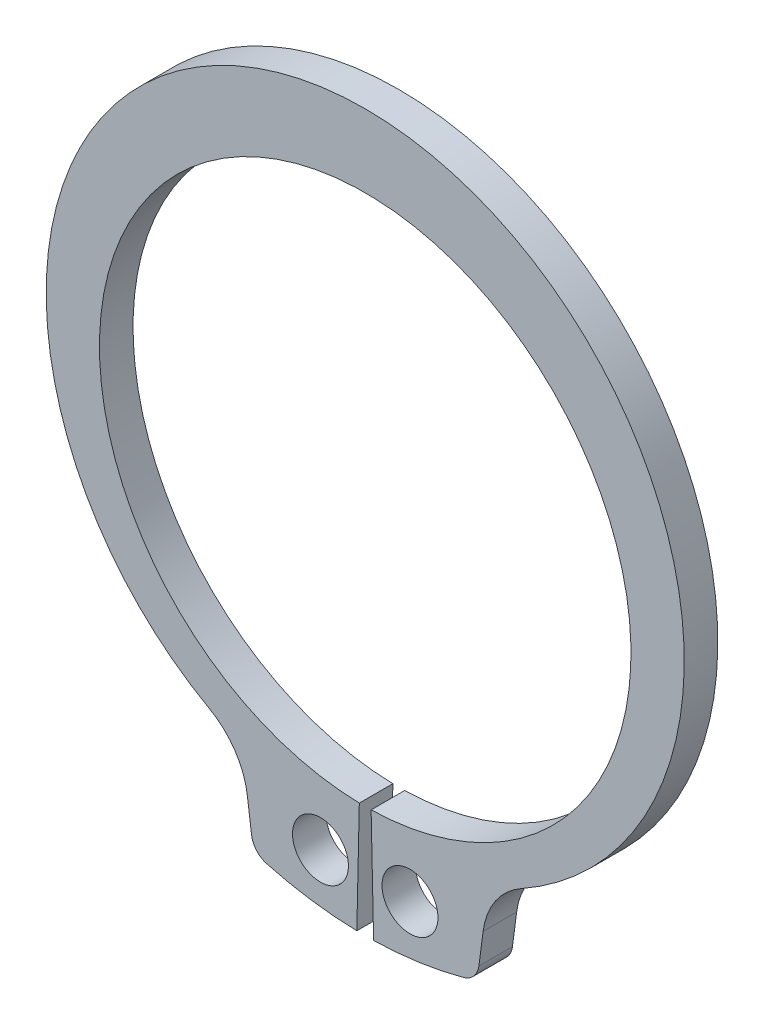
ISO-10303-21;
HEADER;
FILE_DESCRIPTION(('STEP AP214'),'2;1');
FILE_NAME('part.step','',(''),(''),'','','');
FILE_SCHEMA(('AUTOMOTIVE_DESIGN { 1 0 10303 214 1 1 1 1 }'));
ENDSEC;
DATA;
#1=APPLICATION_CONTEXT('core data for automotive mechanical design processes');
#2=APPLICATION_PROTOCOL_DEFINITION('international standard','automotive_design',2000,#1);
#3=PRODUCT_CONTEXT('',#1,'mechanical');
#4=PRODUCT('Part','Part','',(#3));
#5=PRODUCT_RELATED_PRODUCT_CATEGORY('part','',(#4));
#6=PRODUCT_DEFINITION_FORMATION('','',#4);
#7=PRODUCT_DEFINITION_CONTEXT('part definition',#1,'design');
#8=PRODUCT_DEFINITION('design','',#6,#7);
#9=PRODUCT_DEFINITION_SHAPE('','',#8);
#10=(LENGTH_UNIT() NAMED_UNIT(*) SI_UNIT(.MILLI.,.METRE.));
#11=(NAMED_UNIT(*) PLANE_ANGLE_UNIT() SI_UNIT($,.RADIAN.));
#12=(NAMED_UNIT(*) SI_UNIT($,.STERADIAN.) SOLID_ANGLE_UNIT());
#13=UNCERTAINTY_MEASURE_WITH_UNIT(LENGTH_MEASURE(1.E-05),#10,'distance_accuracy_value','');
#14=(GEOMETRIC_REPRESENTATION_CONTEXT(3) GLOBAL_UNCERTAINTY_ASSIGNED_CONTEXT((#13)) GLOBAL_UNIT_ASSIGNED_CONTEXT((#10,
#11,#12)) REPRESENTATION_CONTEXT('',''));
#15=CARTESIAN_POINT('',(0.,0.,0.));
#16=DIRECTION('',(0.,0.,1.));
#17=DIRECTION('',(1.,0.,0.));
#18=AXIS2_PLACEMENT_3D('',#15,#16,#17);
#19=CARTESIAN_POINT('',(0.,0.,-1.19999999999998));
#20=DIRECTION('',(0.,0.,0.999999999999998));
#21=DIRECTION('',(1.,0.,0.));
#22=AXIS2_PLACEMENT_3D('',#19,#20,#21);
#23=CYLINDRICAL_SURFACE('',#22,9.5);
#24=CARTESIAN_POINT('',(0.,0.,0.));
#25=DIRECTION('',(0.,0.,-0.999999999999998));
#26=DIRECTION('',(1.,0.,0.));
#27=AXIS2_PLACEMENT_3D('',#24,#25,#26);
#28=CIRCLE('',#27,9.5);
#29=CARTESIAN_POINT('',(-0.211111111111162,-9.49765403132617,0.));
#30=VERTEX_POINT('',#29);
#31=CARTESIAN_POINT('',(0.211111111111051,-9.49765403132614,0.));
#32=VERTEX_POINT('',#31);
#33=EDGE_CURVE('E131',#30,#32,#28,.T.);
#34=ORIENTED_EDGE('',*,*,#33,.F.);
#35=DIRECTION('',(0.,0.,0.999999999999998));
#36=VECTOR('',#35,1.);
#37=CARTESIAN_POINT('',(-0.211111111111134,-9.49765403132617,-1.19999999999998));
#38=LINE('',#37,#36);
#39=CARTESIAN_POINT('',(-0.211111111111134,-9.49765403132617,-1.19999999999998));
#40=VERTEX_POINT('',#39);
#41=EDGE_CURVE('E11',#40,#30,#38,.T.);
#42=ORIENTED_EDGE('',*,*,#41,.F.);
#43=CARTESIAN_POINT('',(0.,0.,-1.19999999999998));
#44=DIRECTION('',(0.,0.,-0.999999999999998));
#45=DIRECTION('',(1.,0.,0.));
#46=AXIS2_PLACEMENT_3D('',#43,#44,#45);
#47=CIRCLE('',#46,9.5);
#48=CARTESIAN_POINT('',(0.211111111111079,-9.49765403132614,-1.19999999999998));
#49=VERTEX_POINT('',#48);
#50=EDGE_CURVE('E133',#40,#49,#47,.T.);
#51=ORIENTED_EDGE('',*,*,#50,.T.);
#52=DIRECTION('',(0.,0.,0.999999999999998));
#53=VECTOR('',#52,1.);
#54=CARTESIAN_POINT('',(0.211111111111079,-9.49765403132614,-1.19999999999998));
#55=LINE('',#54,#53);
#56=EDGE_CURVE('E45',#49,#32,#55,.T.);
#57=ORIENTED_EDGE('',*,*,#56,.T.);
#58=EDGE_LOOP('',(#34,#42,#51,#57));
#59=FACE_BOUND('',#58,.T.);
#60=ADVANCED_FACE('F42',(#59),#23,.F.);
#61=CARTESIAN_POINT('',(-0.211111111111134,-9.49765403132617,-1.19999999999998));
#62=DIRECTION('',(0.999753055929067,-0.0222222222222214,0.));
#63=DIRECTION('',(0.0222222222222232,0.999753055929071,0.));
#64=AXIS2_PLACEMENT_3D('',#61,#62,#63);
#65=PLANE('',#64);
#66=DIRECTION('',(0.0222222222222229,0.99975305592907,0.));
#67=VECTOR('',#66,1.);
#68=CARTESIAN_POINT('',(-0.211111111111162,-9.49765403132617,0.));
#69=LINE('',#68,#67);
#70=CARTESIAN_POINT('',(-0.30000000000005,-13.4966662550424,0.));
#71=VERTEX_POINT('',#70);
#72=EDGE_CURVE('E151',#71,#30,#69,.T.);
#73=ORIENTED_EDGE('',*,*,#72,.F.);
#74=DIRECTION('',(0.,0.,0.999999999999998));
#75=VECTOR('',#74,1.);
#76=CARTESIAN_POINT('',(-0.30000000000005,-13.4966662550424,-1.19999999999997));
#77=LINE('',#76,#75);
#78=CARTESIAN_POINT('',(-0.30000000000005,-13.4966662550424,-1.19999999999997));
#79=VERTEX_POINT('',#78);
#80=EDGE_CURVE('E51',#79,#71,#77,.T.);
#81=ORIENTED_EDGE('',*,*,#80,.F.);
#82=DIRECTION('',(0.0222222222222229,0.99975305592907,0.));
#83=VECTOR('',#82,1.);
#84=CARTESIAN_POINT('',(-0.211111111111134,-9.49765403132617,-1.19999999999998));
#85=LINE('',#84,#83);
#86=EDGE_CURVE('E139',#79,#40,#85,.T.);
#87=ORIENTED_EDGE('',*,*,#86,.T.);
#88=ORIENTED_EDGE('',*,*,#41,.T.);
#89=EDGE_LOOP('',(#73,#81,#87,#88));
#90=FACE_BOUND('',#89,.T.);
#91=ADVANCED_FACE('F295',(#90),#65,.T.);
#92=CARTESIAN_POINT('',(0.,0.,-1.19999999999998));
#93=DIRECTION('',(0.,0.,0.999999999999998));
#94=DIRECTION('',(1.,0.,0.));
#95=AXIS2_PLACEMENT_3D('',#92,#93,#94);
#96=CYLINDRICAL_SURFACE('',#95,13.5);
#97=CARTESIAN_POINT('',(0.,0.,0.));
#98=DIRECTION('',(0.,0.,0.999999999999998));
#99=DIRECTION('',(1.,0.,0.));
#100=AXIS2_PLACEMENT_3D('',#97,#98,#99);
#101=CIRCLE('',#100,13.5);
#102=CARTESIAN_POINT('',(-3.51438519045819,-13.0345347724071,0.));
#103=VERTEX_POINT('',#102);
#104=EDGE_CURVE('E192',#103,#71,#101,.T.);
#105=ORIENTED_EDGE('',*,*,#104,.F.);
#106=DIRECTION('',(0.,0.,0.999999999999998));
#107=VECTOR('',#106,1.);
#108=CARTESIAN_POINT('',(-3.51438519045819,-13.0345347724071,-1.19999999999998));
#109=LINE('',#108,#107);
#110=CARTESIAN_POINT('',(-3.51438519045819,-13.0345347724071,-1.19999999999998));
#111=VERTEX_POINT('',#110);
#112=EDGE_CURVE('E241',#111,#103,#109,.T.);
#113=ORIENTED_EDGE('',*,*,#112,.F.);
#114=CARTESIAN_POINT('',(0.,0.,-1.19999999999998));
#115=DIRECTION('',(0.,0.,0.999999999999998));
#116=DIRECTION('',(1.,0.,0.));
#117=AXIS2_PLACEMENT_3D('',#114,#115,#116);
#118=CIRCLE('',#117,13.5);
#119=EDGE_CURVE('E234',#111,#79,#118,.T.);
#120=ORIENTED_EDGE('',*,*,#119,.T.);
#121=ORIENTED_EDGE('',*,*,#80,.T.);
#122=EDGE_LOOP('',(#105,#113,#120,#121));
#123=FACE_BOUND('',#122,.T.);
#124=ADVANCED_FACE('F299',(#123),#96,.T.);
#125=CARTESIAN_POINT('',(-3.31914156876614,-12.3103939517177,-1.19999999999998));
#126=DIRECTION('',(0.,0.,0.999999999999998));
#127=DIRECTION('',(1.,0.,0.));
#128=AXIS2_PLACEMENT_3D('',#125,#126,#127);
#129=CYLINDRICAL_SURFACE('',#128,0.75);
#130=CARTESIAN_POINT('',(-3.31914156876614,-12.3103939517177,0.));
#131=DIRECTION('',(0.,0.,0.999999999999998));
#132=DIRECTION('',(1.,0.,0.));
#133=AXIS2_PLACEMENT_3D('',#130,#131,#132);
#134=CIRCLE('',#133,0.75);
#135=CARTESIAN_POINT('',(-4.06272521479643,-12.4082885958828,0.));
#136=VERTEX_POINT('',#135);
#137=EDGE_CURVE('E188',#136,#103,#134,.T.);
#138=ORIENTED_EDGE('',*,*,#137,.F.);
#139=DIRECTION('',(0.,0.,0.999999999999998));
#140=VECTOR('',#139,1.);
#141=CARTESIAN_POINT('',(-4.06272521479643,-12.4082885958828,-1.19999999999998));
#142=LINE('',#141,#140);
#143=CARTESIAN_POINT('',(-4.06272521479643,-12.4082885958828,-1.19999999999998));
#144=VERTEX_POINT('',#143);
#145=EDGE_CURVE('E244',#144,#136,#142,.T.);
#146=ORIENTED_EDGE('',*,*,#145,.F.);
#147=CARTESIAN_POINT('',(-3.31914156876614,-12.3103939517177,-1.19999999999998));
#148=DIRECTION('',(0.,0.,0.999999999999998));
#149=DIRECTION('',(1.,0.,0.));
#150=AXIS2_PLACEMENT_3D('',#147,#148,#149);
#151=CIRCLE('',#150,0.75);
#152=EDGE_CURVE('E230',#144,#111,#151,.T.);
#153=ORIENTED_EDGE('',*,*,#152,.T.);
#154=ORIENTED_EDGE('',*,*,#112,.T.);
#155=EDGE_LOOP('',(#138,#146,#153,#154));
#156=FACE_BOUND('',#155,.T.);
#157=ADVANCED_FACE('F304',(#156),#129,.T.);
#158=CARTESIAN_POINT('',(-4.21429248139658,-11.2570209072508,-1.19999999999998));
#159=DIRECTION('',(-0.991444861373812,-0.130526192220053,0.));
#160=DIRECTION('',(0.130526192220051,-0.991444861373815,0.));
#161=AXIS2_PLACEMENT_3D('',#158,#159,#160);
#162=PLANE('',#161);
#163=DIRECTION('',(0.130526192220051,-0.991444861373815,0.));
#164=VECTOR('',#163,1.);
#165=CARTESIAN_POINT('',(-4.21429248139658,-11.2570209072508,0.));
#166=LINE('',#165,#164);
#167=CARTESIAN_POINT('',(-4.21429248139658,-11.2570209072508,0.));
#168=VERTEX_POINT('',#167);
#169=EDGE_CURVE('E185',#168,#136,#166,.T.);
#170=ORIENTED_EDGE('',*,*,#169,.F.);
#171=DIRECTION('',(0.,0.,0.999999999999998));
#172=VECTOR('',#171,1.);
#173=CARTESIAN_POINT('',(-4.21429248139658,-11.2570209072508,-1.19999999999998));
#174=LINE('',#173,#172);
#175=CARTESIAN_POINT('',(-4.21429248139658,-11.2570209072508,-1.19999999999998));
#176=VERTEX_POINT('',#175);
#177=EDGE_CURVE('E247',#176,#168,#174,.T.);
#178=ORIENTED_EDGE('',*,*,#177,.F.);
#179=DIRECTION('',(0.130526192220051,-0.991444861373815,0.));
#180=VECTOR('',#179,1.);
#181=CARTESIAN_POINT('',(-4.21429248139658,-11.2570209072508,-1.19999999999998));
#182=LINE('',#181,#180);
#183=EDGE_CURVE('E226',#176,#144,#182,.T.);
#184=ORIENTED_EDGE('',*,*,#183,.T.);
#185=ORIENTED_EDGE('',*,*,#145,.T.);
#186=EDGE_LOOP('',(#170,#178,#184,#185));
#187=FACE_BOUND('',#186,.T.);
#188=ADVANCED_FACE('F311',(#187),#162,.T.);
#189=CARTESIAN_POINT('',(-6.89014336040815,-11.6093033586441,-1.19999999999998));
#190=DIRECTION('',(0.,0.,0.999999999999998));
#191=DIRECTION('',(1.,0.,0.));
#192=AXIS2_PLACEMENT_3D('',#189,#190,#191);
#193=CYLINDRICAL_SURFACE('',#192,2.69894069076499);
#194=CARTESIAN_POINT('',(-6.89014336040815,-11.6093033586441,0.));
#195=DIRECTION('',(0.,0.,-0.999999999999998));
#196=DIRECTION('',(1.,0.,0.));
#197=AXIS2_PLACEMENT_3D('',#194,#195,#196);
#198=CIRCLE('',#197,2.69894069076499);
#199=CARTESIAN_POINT('',(-5.57154974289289,-9.25439535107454,0.));
#200=VERTEX_POINT('',#199);
#201=EDGE_CURVE('E181',#200,#168,#198,.T.);
#202=ORIENTED_EDGE('',*,*,#201,.F.);
#203=DIRECTION('',(0.,0.,0.999999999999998));
#204=VECTOR('',#203,1.);
#205=CARTESIAN_POINT('',(-5.57154974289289,-9.25439535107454,-1.19999999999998));
#206=LINE('',#205,#204);
#207=CARTESIAN_POINT('',(-5.57154974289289,-9.25439535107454,-1.19999999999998));
#208=VERTEX_POINT('',#207);
#209=EDGE_CURVE('E250',#208,#200,#206,.T.);
#210=ORIENTED_EDGE('',*,*,#209,.F.);
#211=CARTESIAN_POINT('',(-6.89014336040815,-11.6093033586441,-1.19999999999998));
#212=DIRECTION('',(0.,0.,-0.999999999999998));
#213=DIRECTION('',(1.,0.,0.));
#214=AXIS2_PLACEMENT_3D('',#211,#212,#213);
#215=CIRCLE('',#214,2.69894069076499);
#216=EDGE_CURVE('E222',#208,#176,#215,.T.);
#217=ORIENTED_EDGE('',*,*,#216,.T.);
#218=ORIENTED_EDGE('',*,*,#177,.T.);
#219=EDGE_LOOP('',(#202,#210,#217,#218));
#220=FACE_BOUND('',#219,.T.);
#221=ADVANCED_FACE('F315',(#220),#193,.F.);
#222=CARTESIAN_POINT('',(0.,0.695969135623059,-1.19999999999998));
#223=DIRECTION('',(0.,0.,0.999999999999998));
#224=DIRECTION('',(1.,0.,0.));
#225=AXIS2_PLACEMENT_3D('',#222,#223,#224);
#226=CYLINDRICAL_SURFACE('',#225,11.4040308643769);
#227=CARTESIAN_POINT('',(0.,0.695969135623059,0.));
#228=DIRECTION('',(0.,0.,0.999999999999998));
#229=DIRECTION('',(1.,0.,0.));
#230=AXIS2_PLACEMENT_3D('',#227,#228,#229);
#231=CIRCLE('',#230,11.4040308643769);
#232=CARTESIAN_POINT('',(5.57154974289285,-9.25439535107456,0.));
#233=VERTEX_POINT('',#232);
#234=EDGE_CURVE('E177',#233,#200,#231,.T.);
#235=ORIENTED_EDGE('',*,*,#234,.F.);
#236=DIRECTION('',(0.,0.,0.999999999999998));
#237=VECTOR('',#236,1.);
#238=CARTESIAN_POINT('',(5.57154974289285,-9.25439535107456,-1.19999999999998));
#239=LINE('',#238,#237);
#240=CARTESIAN_POINT('',(5.57154974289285,-9.25439535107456,-1.19999999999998));
#241=VERTEX_POINT('',#240);
#242=EDGE_CURVE('E253',#241,#233,#239,.T.);
#243=ORIENTED_EDGE('',*,*,#242,.F.);
#244=CARTESIAN_POINT('',(0.,0.695969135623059,-1.19999999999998));
#245=DIRECTION('',(0.,0.,0.999999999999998));
#246=DIRECTION('',(1.,0.,0.));
#247=AXIS2_PLACEMENT_3D('',#244,#245,#246);
#248=CIRCLE('',#247,11.4040308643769);
#249=EDGE_CURVE('E218',#241,#208,#248,.T.);
#250=ORIENTED_EDGE('',*,*,#249,.T.);
#251=ORIENTED_EDGE('',*,*,#209,.T.);
#252=EDGE_LOOP('',(#235,#243,#250,#251));
#253=FACE_BOUND('',#252,.T.);
#254=ADVANCED_FACE('F319',(#253),#226,.T.);
#255=CARTESIAN_POINT('',(6.89014336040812,-11.609303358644,-1.19999999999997));
#256=DIRECTION('',(0.,0.,0.999999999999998));
#257=DIRECTION('',(1.,0.,0.));
#258=AXIS2_PLACEMENT_3D('',#255,#256,#257);
#259=CYLINDRICAL_SURFACE('',#258,2.69894069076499);
#260=CARTESIAN_POINT('',(6.89014336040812,-11.609303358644,0.));
#261=DIRECTION('',(0.,0.,-0.999999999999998));
#262=DIRECTION('',(1.,0.,0.));
#263=AXIS2_PLACEMENT_3D('',#260,#261,#262);
#264=CIRCLE('',#263,2.69894069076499);
#265=CARTESIAN_POINT('',(4.21429248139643,-11.2570209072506,0.));
#266=VERTEX_POINT('',#265);
#267=EDGE_CURVE('E173',#266,#233,#264,.T.);
#268=ORIENTED_EDGE('',*,*,#267,.F.);
#269=DIRECTION('',(0.,0.,0.999999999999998));
#270=VECTOR('',#269,1.);
#271=CARTESIAN_POINT('',(4.21429248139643,-11.2570209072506,-1.19999999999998));
#272=LINE('',#271,#270);
#273=CARTESIAN_POINT('',(4.21429248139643,-11.2570209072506,-1.19999999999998));
#274=VERTEX_POINT('',#273);
#275=EDGE_CURVE('E255',#274,#266,#272,.T.);
#276=ORIENTED_EDGE('',*,*,#275,.F.);
#277=CARTESIAN_POINT('',(6.89014336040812,-11.609303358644,-1.19999999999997));
#278=DIRECTION('',(0.,0.,-0.999999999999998));
#279=DIRECTION('',(1.,0.,0.));
#280=AXIS2_PLACEMENT_3D('',#277,#278,#279);
#281=CIRCLE('',#280,2.69894069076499);
#282=EDGE_CURVE('E214',#274,#241,#281,.T.);
#283=ORIENTED_EDGE('',*,*,#282,.T.);
#284=ORIENTED_EDGE('',*,*,#242,.T.);
#285=EDGE_LOOP('',(#268,#276,#283,#284));
#286=FACE_BOUND('',#285,.T.);
#287=ADVANCED_FACE('F323',(#286),#259,.F.);
#288=CARTESIAN_POINT('',(4.21429248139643,-11.2570209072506,-1.19999999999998));
#289=DIRECTION('',(0.991444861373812,-0.130526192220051,0.));
#290=DIRECTION('',(0.130526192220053,0.991444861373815,0.));
#291=AXIS2_PLACEMENT_3D('',#288,#289,#290);
#292=PLANE('',#291);
#293=DIRECTION('',(0.130526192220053,0.991444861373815,0.));
#294=VECTOR('',#293,1.);
#295=CARTESIAN_POINT('',(4.21429248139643,-11.2570209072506,0.));
#296=LINE('',#295,#294);
#297=CARTESIAN_POINT('',(4.06272521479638,-12.4082885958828,0.));
#298=VERTEX_POINT('',#297);
#299=EDGE_CURVE('E169',#298,#266,#296,.T.);
#300=ORIENTED_EDGE('',*,*,#299,.F.);
#301=DIRECTION('',(0.,0.,0.999999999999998));
#302=VECTOR('',#301,1.);
#303=CARTESIAN_POINT('',(4.06272521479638,-12.4082885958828,-1.19999999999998));
#304=LINE('',#303,#302);
#305=CARTESIAN_POINT('',(4.06272521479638,-12.4082885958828,-1.19999999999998));
#306=VERTEX_POINT('',#305);
#307=EDGE_CURVE('E258',#306,#298,#304,.T.);
#308=ORIENTED_EDGE('',*,*,#307,.F.);
#309=DIRECTION('',(0.130526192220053,0.991444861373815,0.));
#310=VECTOR('',#309,1.);
#311=CARTESIAN_POINT('',(4.21429248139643,-11.2570209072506,-1.19999999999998));
#312=LINE('',#311,#310);
#313=EDGE_CURVE('E210',#306,#274,#312,.T.);
#314=ORIENTED_EDGE('',*,*,#313,.T.);
#315=ORIENTED_EDGE('',*,*,#275,.T.);
#316=EDGE_LOOP('',(#300,#308,#314,#315));
#317=FACE_BOUND('',#316,.T.);
#318=ADVANCED_FACE('F327',(#317),#292,.T.);
#319=CARTESIAN_POINT('',(3.31914156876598,-12.3103939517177,-1.19999999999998));
#320=DIRECTION('',(0.,0.,0.999999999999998));
#321=DIRECTION('',(1.,0.,0.));
#322=AXIS2_PLACEMENT_3D('',#319,#320,#321);
#323=CYLINDRICAL_SURFACE('',#322,0.75);
#324=CARTESIAN_POINT('',(3.31914156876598,-12.3103939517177,0.));
#325=DIRECTION('',(0.,0.,0.999999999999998));
#326=DIRECTION('',(-1.,0.,0.));
#327=AXIS2_PLACEMENT_3D('',#324,#325,#326);
#328=CIRCLE('',#327,0.75);
#329=CARTESIAN_POINT('',(3.51438519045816,-13.034534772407,0.));
#330=VERTEX_POINT('',#329);
#331=EDGE_CURVE('E165',#330,#298,#328,.T.);
#332=ORIENTED_EDGE('',*,*,#331,.F.);
#333=DIRECTION('',(0.,0.,0.999999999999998));
#334=VECTOR('',#333,1.);
#335=CARTESIAN_POINT('',(3.51438519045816,-13.034534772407,-1.19999999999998));
#336=LINE('',#335,#334);
#337=CARTESIAN_POINT('',(3.51438519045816,-13.034534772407,-1.19999999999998));
#338=VERTEX_POINT('',#337);
#339=EDGE_CURVE('E261',#338,#330,#336,.T.);
#340=ORIENTED_EDGE('',*,*,#339,.F.);
#341=CARTESIAN_POINT('',(3.31914156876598,-12.3103939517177,-1.19999999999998));
#342=DIRECTION('',(0.,0.,0.999999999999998));
#343=DIRECTION('',(-1.,0.,0.));
#344=AXIS2_PLACEMENT_3D('',#341,#342,#343);
#345=CIRCLE('',#344,0.75);
#346=EDGE_CURVE('E206',#338,#306,#345,.T.);
#347=ORIENTED_EDGE('',*,*,#346,.T.);
#348=ORIENTED_EDGE('',*,*,#307,.T.);
#349=EDGE_LOOP('',(#332,#340,#347,#348));
#350=FACE_BOUND('',#349,.T.);
#351=ADVANCED_FACE('F331',(#350),#323,.T.);
#352=CARTESIAN_POINT('',(0.,0.,-1.19999999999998));
#353=DIRECTION('',(0.,0.,0.999999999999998));
#354=DIRECTION('',(1.,0.,0.));
#355=AXIS2_PLACEMENT_3D('',#352,#353,#354);
#356=CYLINDRICAL_SURFACE('',#355,13.5);
#357=CARTESIAN_POINT('',(0.,0.,0.));
#358=DIRECTION('',(0.,0.,0.999999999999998));
#359=DIRECTION('',(1.,0.,0.));
#360=AXIS2_PLACEMENT_3D('',#357,#358,#359);
#361=CIRCLE('',#360,13.5);
#362=CARTESIAN_POINT('',(0.299999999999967,-13.4966662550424,0.));
#363=VERTEX_POINT('',#362);
#364=EDGE_CURVE('E147',#363,#330,#361,.T.);
#365=ORIENTED_EDGE('',*,*,#364,.F.);
#366=DIRECTION('',(0.,0.,0.999999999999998));
#367=VECTOR('',#366,1.);
#368=CARTESIAN_POINT('',(0.299999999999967,-13.4966662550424,-1.19999999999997));
#369=LINE('',#368,#367);
#370=CARTESIAN_POINT('',(0.299999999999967,-13.4966662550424,-1.19999999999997));
#371=VERTEX_POINT('',#370);
#372=EDGE_CURVE('E138',#371,#363,#369,.T.);
#373=ORIENTED_EDGE('',*,*,#372,.F.);
#374=CARTESIAN_POINT('',(0.,0.,-1.19999999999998));
#375=DIRECTION('',(0.,0.,0.999999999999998));
#376=DIRECTION('',(1.,0.,0.));
#377=AXIS2_PLACEMENT_3D('',#374,#375,#376);
#378=CIRCLE('',#377,13.5);
#379=EDGE_CURVE('E202',#371,#338,#378,.T.);
#380=ORIENTED_EDGE('',*,*,#379,.T.);
#381=ORIENTED_EDGE('',*,*,#339,.T.);
#382=EDGE_LOOP('',(#365,#373,#380,#381));
#383=FACE_BOUND('',#382,.T.);
#384=ADVANCED_FACE('F335',(#383),#356,.T.);
#385=CARTESIAN_POINT('',(0.211111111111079,-9.49765403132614,-1.19999999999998));
#386=DIRECTION('',(-0.999753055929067,-0.0222222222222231,0.));
#387=DIRECTION('',(0.0222222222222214,-0.99975305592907,0.));
#388=AXIS2_PLACEMENT_3D('',#385,#386,#387);
#389=PLANE('',#388);
#390=DIRECTION('',(0.0222222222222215,-0.99975305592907,0.));
#391=VECTOR('',#390,1.);
#392=CARTESIAN_POINT('',(0.211111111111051,-9.49765403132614,0.));
#393=LINE('',#392,#391);
#394=EDGE_CURVE('E141',#32,#363,#393,.T.);
#395=ORIENTED_EDGE('',*,*,#394,.F.);
#396=ORIENTED_EDGE('',*,*,#56,.F.);
#397=DIRECTION('',(0.0222222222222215,-0.99975305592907,0.));
#398=VECTOR('',#397,1.);
#399=CARTESIAN_POINT('',(0.211111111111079,-9.49765403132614,-1.19999999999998));
#400=LINE('',#399,#398);
#401=EDGE_CURVE('E199',#49,#371,#400,.T.);
#402=ORIENTED_EDGE('',*,*,#401,.T.);
#403=ORIENTED_EDGE('',*,*,#372,.T.);
#404=EDGE_LOOP('',(#395,#396,#402,#403));
#405=FACE_BOUND('',#404,.T.);
#406=ADVANCED_FACE('F142',(#405),#389,.T.);
#407=CARTESIAN_POINT('',(0.,0.,-1.19999999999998));
#408=DIRECTION('',(0.,0.,0.999999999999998));
#409=DIRECTION('',(1.,0.,0.));
#410=AXIS2_PLACEMENT_3D('',#407,#408,#409);
#411=PLANE('',#410);
#412=CARTESIAN_POINT('',(-1.60000000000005,-11.6405541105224,-1.19999999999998));
#413=DIRECTION('',(0.,0.,0.999999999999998));
#414=DIRECTION('',(1.,0.,0.));
#415=AXIS2_PLACEMENT_3D('',#412,#413,#414);
#416=CIRCLE('',#415,1.);
#417=CARTESIAN_POINT('',(-0.600000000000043,-11.6405541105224,-1.19999999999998));
#418=VERTEX_POINT('',#417);
#419=EDGE_CURVE('E267',#418,#418,#416,.T.);
#420=ORIENTED_EDGE('',*,*,#419,.T.);
#421=EDGE_LOOP('',(#420));
#422=FACE_BOUND('',#421,.T.);
#423=CARTESIAN_POINT('',(1.59999999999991,-11.6405541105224,-1.19999999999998));
#424=DIRECTION('',(0.,0.,0.999999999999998));
#425=DIRECTION('',(1.,0.,0.));
#426=AXIS2_PLACEMENT_3D('',#423,#424,#425);
#427=CIRCLE('',#426,1.);
#428=CARTESIAN_POINT('',(2.59999999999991,-11.6405541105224,-1.19999999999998));
#429=VERTEX_POINT('',#428);
#430=EDGE_CURVE('E153',#429,#429,#427,.T.);
#431=ORIENTED_EDGE('',*,*,#430,.T.);
#432=EDGE_LOOP('',(#431));
#433=FACE_BOUND('',#432,.T.);
#434=ORIENTED_EDGE('',*,*,#50,.F.);
#435=ORIENTED_EDGE('',*,*,#86,.F.);
#436=ORIENTED_EDGE('',*,*,#119,.F.);
#437=ORIENTED_EDGE('',*,*,#152,.F.);
#438=ORIENTED_EDGE('',*,*,#183,.F.);
#439=ORIENTED_EDGE('',*,*,#216,.F.);
#440=ORIENTED_EDGE('',*,*,#249,.F.);
#441=ORIENTED_EDGE('',*,*,#282,.F.);
#442=ORIENTED_EDGE('',*,*,#313,.F.);
#443=ORIENTED_EDGE('',*,*,#346,.F.);
#444=ORIENTED_EDGE('',*,*,#379,.F.);
#445=ORIENTED_EDGE('',*,*,#401,.F.);
#446=EDGE_LOOP('',(#434,#435,#436,#437,#438,#439,#440,#441,#442,#443,#444,#445));
#447=FACE_BOUND('',#446,.T.);
#448=ADVANCED_FACE('F281',(#422,#433,#447),#411,.F.);
#449=CARTESIAN_POINT('',(0.,0.,0.));
#450=DIRECTION('',(0.,0.,0.999999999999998));
#451=DIRECTION('',(1.,0.,0.));
#452=AXIS2_PLACEMENT_3D('',#449,#450,#451);
#453=PLANE('',#452);
#454=CARTESIAN_POINT('',(-1.60000000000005,-11.6405541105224,0.));
#455=DIRECTION('',(0.,0.,0.999999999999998));
#456=DIRECTION('',(1.,0.,0.));
#457=AXIS2_PLACEMENT_3D('',#454,#455,#456);
#458=CIRCLE('',#457,1.);
#459=CARTESIAN_POINT('',(-0.600000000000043,-11.6405541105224,0.));
#460=VERTEX_POINT('',#459);
#461=EDGE_CURVE('E269',#460,#460,#458,.T.);
#462=ORIENTED_EDGE('',*,*,#461,.F.);
#463=EDGE_LOOP('',(#462));
#464=FACE_BOUND('',#463,.T.);
#465=CARTESIAN_POINT('',(1.59999999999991,-11.6405541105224,0.));
#466=DIRECTION('',(0.,0.,0.999999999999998));
#467=DIRECTION('',(1.,0.,0.));
#468=AXIS2_PLACEMENT_3D('',#465,#466,#467);
#469=CIRCLE('',#468,1.);
#470=CARTESIAN_POINT('',(2.59999999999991,-11.6405541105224,0.));
#471=VERTEX_POINT('',#470);
#472=EDGE_CURVE('E159',#471,#471,#469,.T.);
#473=ORIENTED_EDGE('',*,*,#472,.F.);
#474=EDGE_LOOP('',(#473));
#475=FACE_BOUND('',#474,.T.);
#476=ORIENTED_EDGE('',*,*,#33,.T.);
#477=ORIENTED_EDGE('',*,*,#394,.T.);
#478=ORIENTED_EDGE('',*,*,#364,.T.);
#479=ORIENTED_EDGE('',*,*,#331,.T.);
#480=ORIENTED_EDGE('',*,*,#299,.T.);
#481=ORIENTED_EDGE('',*,*,#267,.T.);
#482=ORIENTED_EDGE('',*,*,#234,.T.);
#483=ORIENTED_EDGE('',*,*,#201,.T.);
#484=ORIENTED_EDGE('',*,*,#169,.T.);
#485=ORIENTED_EDGE('',*,*,#137,.T.);
#486=ORIENTED_EDGE('',*,*,#104,.T.);
#487=ORIENTED_EDGE('',*,*,#72,.T.);
#488=EDGE_LOOP('',(#476,#477,#478,#479,#480,#481,#482,#483,#484,#485,#486,#487));
#489=FACE_BOUND('',#488,.T.);
#490=ADVANCED_FACE('F149',(#464,#475,#489),#453,.T.);
#491=CARTESIAN_POINT('',(1.59999999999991,-11.6405541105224,-1.19999999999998));
#492=DIRECTION('',(0.,0.,0.999999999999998));
#493=DIRECTION('',(1.,0.,0.));
#494=AXIS2_PLACEMENT_3D('',#491,#492,#493);
#495=CYLINDRICAL_SURFACE('',#494,1.);
#496=CARTESIAN_POINT('',(2.59999999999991,-11.6405541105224,-1.19999999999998));
#497=CARTESIAN_POINT('',(2.59999999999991,-11.6405541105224,-1.18749999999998));
#498=CARTESIAN_POINT('',(2.59999999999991,-11.6405541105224,-1.17499999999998));
#499=CARTESIAN_POINT('',(2.59999999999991,-11.6405541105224,-1.14999999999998));
#500=CARTESIAN_POINT('',(2.59999999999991,-11.6405541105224,-1.13749999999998));
#501=CARTESIAN_POINT('',(2.59999999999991,-11.6405541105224,-1.11249999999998));
#502=CARTESIAN_POINT('',(2.59999999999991,-11.6405541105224,-1.09999999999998));
#503=CARTESIAN_POINT('',(2.59999999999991,-11.6405541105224,-1.07499999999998));
#504=CARTESIAN_POINT('',(2.59999999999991,-11.6405541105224,-1.06249999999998));
#505=CARTESIAN_POINT('',(2.59999999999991,-11.6405541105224,-1.03749999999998));
#506=CARTESIAN_POINT('',(2.59999999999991,-11.6405541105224,-1.02499999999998));
#507=CARTESIAN_POINT('',(2.59999999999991,-11.6405541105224,-0.999999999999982));
#508=CARTESIAN_POINT('',(2.59999999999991,-11.6405541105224,-0.987499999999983));
#509=CARTESIAN_POINT('',(2.59999999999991,-11.6405541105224,-0.962499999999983));
#510=CARTESIAN_POINT('',(2.59999999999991,-11.6405541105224,-0.949999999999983));
#511=CARTESIAN_POINT('',(2.59999999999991,-11.6405541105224,-0.924999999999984));
#512=CARTESIAN_POINT('',(2.59999999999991,-11.6405541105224,-0.912499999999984));
#513=CARTESIAN_POINT('',(2.59999999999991,-11.6405541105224,-0.887499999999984));
#514=CARTESIAN_POINT('',(2.59999999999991,-11.6405541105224,-0.874999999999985));
#515=CARTESIAN_POINT('',(2.59999999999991,-11.6405541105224,-0.849999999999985));
#516=CARTESIAN_POINT('',(2.59999999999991,-11.6405541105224,-0.837499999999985));
#517=CARTESIAN_POINT('',(2.59999999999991,-11.6405541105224,-0.812499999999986));
#518=CARTESIAN_POINT('',(2.59999999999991,-11.6405541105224,-0.799999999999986));
#519=CARTESIAN_POINT('',(2.59999999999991,-11.6405541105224,-0.774999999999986));
#520=CARTESIAN_POINT('',(2.59999999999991,-11.6405541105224,-0.762499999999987));
#521=CARTESIAN_POINT('',(2.59999999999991,-11.6405541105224,-0.737499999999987));
#522=CARTESIAN_POINT('',(2.59999999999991,-11.6405541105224,-0.724999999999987));
#523=CARTESIAN_POINT('',(2.59999999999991,-11.6405541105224,-0.699999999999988));
#524=CARTESIAN_POINT('',(2.59999999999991,-11.6405541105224,-0.687499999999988));
#525=CARTESIAN_POINT('',(2.59999999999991,-11.6405541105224,-0.662499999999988));
#526=CARTESIAN_POINT('',(2.59999999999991,-11.6405541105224,-0.649999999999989));
#527=CARTESIAN_POINT('',(2.59999999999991,-11.6405541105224,-0.624999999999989));
#528=CARTESIAN_POINT('',(2.59999999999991,-11.6405541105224,-0.612499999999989));
#529=CARTESIAN_POINT('',(2.59999999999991,-11.6405541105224,-0.58749999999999));
#530=CARTESIAN_POINT('',(2.59999999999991,-11.6405541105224,-0.57499999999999));
#531=CARTESIAN_POINT('',(2.59999999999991,-11.6405541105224,-0.54999999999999));
#532=CARTESIAN_POINT('',(2.59999999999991,-11.6405541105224,-0.537499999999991));
#533=CARTESIAN_POINT('',(2.59999999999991,-11.6405541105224,-0.512499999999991));
#534=CARTESIAN_POINT('',(2.59999999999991,-11.6405541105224,-0.499999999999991));
#535=CARTESIAN_POINT('',(2.59999999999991,-11.6405541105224,-0.474999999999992));
#536=CARTESIAN_POINT('',(2.59999999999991,-11.6405541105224,-0.462499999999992));
#537=CARTESIAN_POINT('',(2.59999999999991,-11.6405541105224,-0.437499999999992));
#538=CARTESIAN_POINT('',(2.59999999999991,-11.6405541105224,-0.424999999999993));
#539=CARTESIAN_POINT('',(2.59999999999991,-11.6405541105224,-0.399999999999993));
#540=CARTESIAN_POINT('',(2.59999999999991,-11.6405541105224,-0.387499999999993));
#541=CARTESIAN_POINT('',(2.59999999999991,-11.6405541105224,-0.362499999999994));
#542=CARTESIAN_POINT('',(2.59999999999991,-11.6405541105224,-0.349999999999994));
#543=CARTESIAN_POINT('',(2.59999999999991,-11.6405541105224,-0.324999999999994));
#544=CARTESIAN_POINT('',(2.59999999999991,-11.6405541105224,-0.312499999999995));
#545=CARTESIAN_POINT('',(2.59999999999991,-11.6405541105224,-0.287499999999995));
#546=CARTESIAN_POINT('',(2.59999999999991,-11.6405541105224,-0.274999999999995));
#547=CARTESIAN_POINT('',(2.59999999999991,-11.6405541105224,-0.249999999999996));
#548=CARTESIAN_POINT('',(2.59999999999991,-11.6405541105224,-0.237499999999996));
#549=CARTESIAN_POINT('',(2.59999999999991,-11.6405541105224,-0.212499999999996));
#550=CARTESIAN_POINT('',(2.59999999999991,-11.6405541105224,-0.199999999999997));
#551=CARTESIAN_POINT('',(2.59999999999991,-11.6405541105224,-0.174999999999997));
#552=CARTESIAN_POINT('',(2.59999999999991,-11.6405541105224,-0.162499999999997));
#553=CARTESIAN_POINT('',(2.59999999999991,-11.6405541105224,-0.137499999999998));
#554=CARTESIAN_POINT('',(2.59999999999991,-11.6405541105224,-0.124999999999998));
#555=CARTESIAN_POINT('',(2.59999999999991,-11.6405541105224,-0.0999999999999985));
#556=CARTESIAN_POINT('',(2.59999999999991,-11.6405541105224,-0.0874999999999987));
#557=CARTESIAN_POINT('',(2.59999999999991,-11.6405541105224,-0.0624999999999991));
#558=CARTESIAN_POINT('',(2.59999999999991,-11.6405541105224,-0.0499999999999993));
#559=CARTESIAN_POINT('',(2.59999999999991,-11.6405541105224,-0.0249999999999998));
#560=CARTESIAN_POINT('',(2.59999999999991,-11.6405541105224,-0.0125));
#561=CARTESIAN_POINT('',(2.59999999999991,-11.6405541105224,0.));
#562=B_SPLINE_CURVE_WITH_KNOTS('',3,(#496,#497,#498,#499,#500,#501,#502,#503,#504,#505,#506,
#507,#508,#509,#510,#511,#512,#513,#514,#515,#516,#517,#518,#519,#520,#521,#522,#523,#524,#525,
#526,#527,#528,#529,#530,#531,#532,#533,#534,#535,#536,#537,#538,#539,#540,#541,#542,#543,#544,
#545,#546,#547,#548,#549,#550,#551,#552,#553,#554,#555,#556,#557,#558,#559,#560,#561),
.UNSPECIFIED.,.F.,.F.,(4,2,2,2,2,2,2,2,2,2,2,2,2,2,2,2,2,2,2,2,2,2,2,2,2,2,2,2,2,2,2,2,4),(0.,
0.0374999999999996,0.0749999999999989,0.112499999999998,0.149999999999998,0.187499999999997,
0.224999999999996,0.262499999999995,0.299999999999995,0.337499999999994,0.374999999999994,
0.412499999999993,0.449999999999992,0.487499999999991,0.524999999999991,0.56249999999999,
0.59999999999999,0.637499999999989,0.674999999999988,0.712499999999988,0.749999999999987,
0.787499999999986,0.824999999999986,0.862499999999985,0.899999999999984,0.937499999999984,
0.974999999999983,1.01249999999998,1.04999999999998,1.08749999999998,1.12499999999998,
1.16249999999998,1.19999999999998),.UNSPECIFIED.);
#563=EDGE_CURVE('BSEAM280',#429,#471,#562,.T.);
#564=ORIENTED_EDGE('',*,*,#430,.F.);
#565=ORIENTED_EDGE('',*,*,#472,.T.);
#566=ORIENTED_EDGE('',*,*,#563,.T.);
#567=ORIENTED_EDGE('',*,*,#563,.F.);
#568=EDGE_LOOP('',(#564,#566,#565,#567));
#569=FACE_BOUND('',#568,.T.);
#570=ADVANCED_FACE('F280',(#569),#495,.F.);
#571=CARTESIAN_POINT('',(-1.60000000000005,-11.6405541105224,-1.19999999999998));
#572=DIRECTION('',(0.,0.,0.999999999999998));
#573=DIRECTION('',(1.,0.,0.));
#574=AXIS2_PLACEMENT_3D('',#571,#572,#573);
#575=CYLINDRICAL_SURFACE('',#574,1.);
#576=CARTESIAN_POINT('',(-0.600000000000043,-11.6405541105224,-1.19999999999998));
#577=CARTESIAN_POINT('',(-0.600000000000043,-11.6405541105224,-1.18749999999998));
#578=CARTESIAN_POINT('',(-0.600000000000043,-11.6405541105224,-1.17499999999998));
#579=CARTESIAN_POINT('',(-0.600000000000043,-11.6405541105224,-1.14999999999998));
#580=CARTESIAN_POINT('',(-0.600000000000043,-11.6405541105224,-1.13749999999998));
#581=CARTESIAN_POINT('',(-0.600000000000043,-11.6405541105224,-1.11249999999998));
#582=CARTESIAN_POINT('',(-0.600000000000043,-11.6405541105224,-1.09999999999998));
#583=CARTESIAN_POINT('',(-0.600000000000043,-11.6405541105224,-1.07499999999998));
#584=CARTESIAN_POINT('',(-0.600000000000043,-11.6405541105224,-1.06249999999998));
#585=CARTESIAN_POINT('',(-0.600000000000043,-11.6405541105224,-1.03749999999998));
#586=CARTESIAN_POINT('',(-0.600000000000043,-11.6405541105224,-1.02499999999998));
#587=CARTESIAN_POINT('',(-0.600000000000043,-11.6405541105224,-0.999999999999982));
#588=CARTESIAN_POINT('',(-0.600000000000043,-11.6405541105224,-0.987499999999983));
#589=CARTESIAN_POINT('',(-0.600000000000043,-11.6405541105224,-0.962499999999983));
#590=CARTESIAN_POINT('',(-0.600000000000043,-11.6405541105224,-0.949999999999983));
#591=CARTESIAN_POINT('',(-0.600000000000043,-11.6405541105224,-0.924999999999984));
#592=CARTESIAN_POINT('',(-0.600000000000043,-11.6405541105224,-0.912499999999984));
#593=CARTESIAN_POINT('',(-0.600000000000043,-11.6405541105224,-0.887499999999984));
#594=CARTESIAN_POINT('',(-0.600000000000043,-11.6405541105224,-0.874999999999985));
#595=CARTESIAN_POINT('',(-0.600000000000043,-11.6405541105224,-0.849999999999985));
#596=CARTESIAN_POINT('',(-0.600000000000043,-11.6405541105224,-0.837499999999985));
#597=CARTESIAN_POINT('',(-0.600000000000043,-11.6405541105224,-0.812499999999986));
#598=CARTESIAN_POINT('',(-0.600000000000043,-11.6405541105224,-0.799999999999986));
#599=CARTESIAN_POINT('',(-0.600000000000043,-11.6405541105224,-0.774999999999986));
#600=CARTESIAN_POINT('',(-0.600000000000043,-11.6405541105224,-0.762499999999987));
#601=CARTESIAN_POINT('',(-0.600000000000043,-11.6405541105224,-0.737499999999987));
#602=CARTESIAN_POINT('',(-0.600000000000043,-11.6405541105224,-0.724999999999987));
#603=CARTESIAN_POINT('',(-0.600000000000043,-11.6405541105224,-0.699999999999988));
#604=CARTESIAN_POINT('',(-0.600000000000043,-11.6405541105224,-0.687499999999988));
#605=CARTESIAN_POINT('',(-0.600000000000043,-11.6405541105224,-0.662499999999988));
#606=CARTESIAN_POINT('',(-0.600000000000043,-11.6405541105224,-0.649999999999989));
#607=CARTESIAN_POINT('',(-0.600000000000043,-11.6405541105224,-0.624999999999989));
#608=CARTESIAN_POINT('',(-0.600000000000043,-11.6405541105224,-0.612499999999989));
#609=CARTESIAN_POINT('',(-0.600000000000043,-11.6405541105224,-0.58749999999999));
#610=CARTESIAN_POINT('',(-0.600000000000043,-11.6405541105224,-0.57499999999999));
#611=CARTESIAN_POINT('',(-0.600000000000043,-11.6405541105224,-0.54999999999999));
#612=CARTESIAN_POINT('',(-0.600000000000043,-11.6405541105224,-0.537499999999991));
#613=CARTESIAN_POINT('',(-0.600000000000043,-11.6405541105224,-0.512499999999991));
#614=CARTESIAN_POINT('',(-0.600000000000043,-11.6405541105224,-0.499999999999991));
#615=CARTESIAN_POINT('',(-0.600000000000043,-11.6405541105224,-0.474999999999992));
#616=CARTESIAN_POINT('',(-0.600000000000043,-11.6405541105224,-0.462499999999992));
#617=CARTESIAN_POINT('',(-0.600000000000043,-11.6405541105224,-0.437499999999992));
#618=CARTESIAN_POINT('',(-0.600000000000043,-11.6405541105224,-0.424999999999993));
#619=CARTESIAN_POINT('',(-0.600000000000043,-11.6405541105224,-0.399999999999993));
#620=CARTESIAN_POINT('',(-0.600000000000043,-11.6405541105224,-0.387499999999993));
#621=CARTESIAN_POINT('',(-0.600000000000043,-11.6405541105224,-0.362499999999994));
#622=CARTESIAN_POINT('',(-0.600000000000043,-11.6405541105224,-0.349999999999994));
#623=CARTESIAN_POINT('',(-0.600000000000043,-11.6405541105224,-0.324999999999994));
#624=CARTESIAN_POINT('',(-0.600000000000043,-11.6405541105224,-0.312499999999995));
#625=CARTESIAN_POINT('',(-0.600000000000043,-11.6405541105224,-0.287499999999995));
#626=CARTESIAN_POINT('',(-0.600000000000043,-11.6405541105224,-0.274999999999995));
#627=CARTESIAN_POINT('',(-0.600000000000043,-11.6405541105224,-0.249999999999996));
#628=CARTESIAN_POINT('',(-0.600000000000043,-11.6405541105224,-0.237499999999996));
#629=CARTESIAN_POINT('',(-0.600000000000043,-11.6405541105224,-0.212499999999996));
#630=CARTESIAN_POINT('',(-0.600000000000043,-11.6405541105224,-0.199999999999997));
#631=CARTESIAN_POINT('',(-0.600000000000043,-11.6405541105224,-0.174999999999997));
#632=CARTESIAN_POINT('',(-0.600000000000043,-11.6405541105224,-0.162499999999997));
#633=CARTESIAN_POINT('',(-0.600000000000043,-11.6405541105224,-0.137499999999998));
#634=CARTESIAN_POINT('',(-0.600000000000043,-11.6405541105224,-0.124999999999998));
#635=CARTESIAN_POINT('',(-0.600000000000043,-11.6405541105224,-0.0999999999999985));
#636=CARTESIAN_POINT('',(-0.600000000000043,-11.6405541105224,-0.0874999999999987));
#637=CARTESIAN_POINT('',(-0.600000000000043,-11.6405541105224,-0.0624999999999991));
#638=CARTESIAN_POINT('',(-0.600000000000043,-11.6405541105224,-0.0499999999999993));
#639=CARTESIAN_POINT('',(-0.600000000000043,-11.6405541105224,-0.0249999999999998));
#640=CARTESIAN_POINT('',(-0.600000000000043,-11.6405541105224,-0.0125));
#641=CARTESIAN_POINT('',(-0.600000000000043,-11.6405541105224,0.));
#642=B_SPLINE_CURVE_WITH_KNOTS('',3,(#576,#577,#578,#579,#580,#581,#582,#583,#584,#585,#586,
#587,#588,#589,#590,#591,#592,#593,#594,#595,#596,#597,#598,#599,#600,#601,#602,#603,#604,#605,
#606,#607,#608,#609,#610,#611,#612,#613,#614,#615,#616,#617,#618,#619,#620,#621,#622,#623,#624,
#625,#626,#627,#628,#629,#630,#631,#632,#633,#634,#635,#636,#637,#638,#639,#640,#641),
.UNSPECIFIED.,.F.,.F.,(4,2,2,2,2,2,2,2,2,2,2,2,2,2,2,2,2,2,2,2,2,2,2,2,2,2,2,2,2,2,2,2,4),(0.,
0.0374999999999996,0.0749999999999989,0.112499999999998,0.149999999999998,0.187499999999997,
0.224999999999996,0.262499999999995,0.299999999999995,0.337499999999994,0.374999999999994,
0.412499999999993,0.449999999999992,0.487499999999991,0.524999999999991,0.56249999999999,
0.59999999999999,0.637499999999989,0.674999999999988,0.712499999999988,0.749999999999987,
0.787499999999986,0.824999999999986,0.862499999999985,0.899999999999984,0.937499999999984,
0.974999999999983,1.01249999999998,1.04999999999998,1.08749999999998,1.12499999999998,
1.16249999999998,1.19999999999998),.UNSPECIFIED.);
#643=EDGE_CURVE('BSEAM276',#418,#460,#642,.T.);
#644=ORIENTED_EDGE('',*,*,#419,.F.);
#645=ORIENTED_EDGE('',*,*,#461,.T.);
#646=ORIENTED_EDGE('',*,*,#643,.T.);
#647=ORIENTED_EDGE('',*,*,#643,.F.);
#648=EDGE_LOOP('',(#644,#646,#645,#647));
#649=FACE_BOUND('',#648,.T.);
#650=ADVANCED_FACE('F276',(#649),#575,.F.);
#651=CLOSED_SHELL('',(#60,#91,#124,#157,#188,#221,#254,#287,#318,#351,#384,#406,#448,#490,#570,#650));
#652=MANIFOLD_SOLID_BREP('B2',#651);
#653=ADVANCED_BREP_SHAPE_REPRESENTATION('',(#18,#652),#14);
#654=SHAPE_DEFINITION_REPRESENTATION(#9,#653);
ENDSEC;
END-ISO-10303-21;
